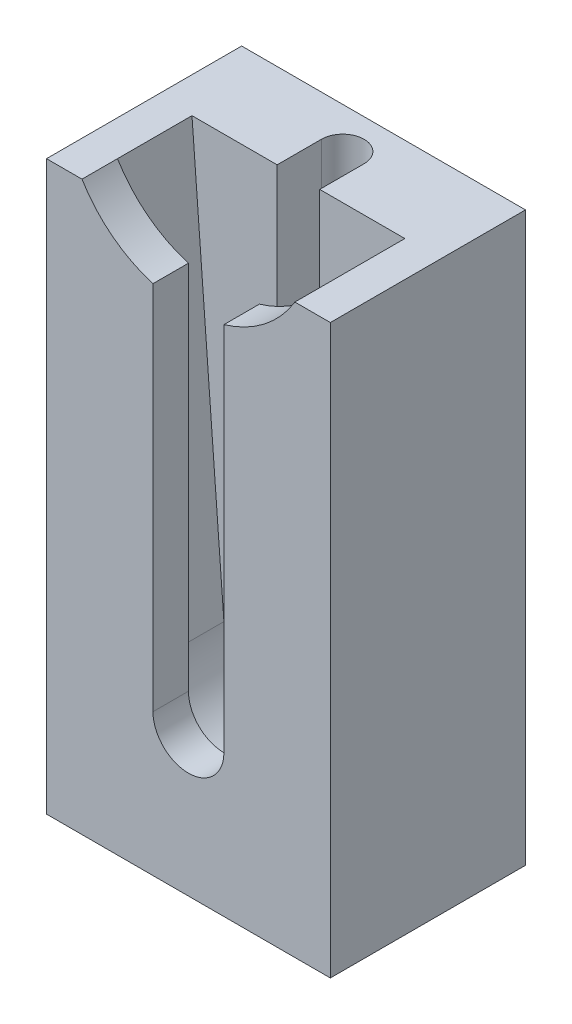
ISO-10303-21;
HEADER;
FILE_DESCRIPTION(('STEP AP214'),'2;1');
FILE_NAME('part.step','',(''),(''),'','','');
FILE_SCHEMA(('AUTOMOTIVE_DESIGN { 1 0 10303 214 1 1 1 1 }'));
ENDSEC;
DATA;
#1=APPLICATION_CONTEXT('core data for automotive mechanical design processes');
#2=APPLICATION_PROTOCOL_DEFINITION('international standard','automotive_design',2000,#1);
#3=PRODUCT_CONTEXT('',#1,'mechanical');
#4=PRODUCT('Part','Part','',(#3));
#5=PRODUCT_RELATED_PRODUCT_CATEGORY('part','',(#4));
#6=PRODUCT_DEFINITION_FORMATION('','',#4);
#7=PRODUCT_DEFINITION_CONTEXT('part definition',#1,'design');
#8=PRODUCT_DEFINITION('design','',#6,#7);
#9=PRODUCT_DEFINITION_SHAPE('','',#8);
#10=(LENGTH_UNIT() NAMED_UNIT(*) SI_UNIT(.MILLI.,.METRE.));
#11=(NAMED_UNIT(*) PLANE_ANGLE_UNIT() SI_UNIT($,.RADIAN.));
#12=(NAMED_UNIT(*) SI_UNIT($,.STERADIAN.) SOLID_ANGLE_UNIT());
#13=UNCERTAINTY_MEASURE_WITH_UNIT(LENGTH_MEASURE(1.E-05),#10,'distance_accuracy_value','');
#14=(GEOMETRIC_REPRESENTATION_CONTEXT(3) GLOBAL_UNCERTAINTY_ASSIGNED_CONTEXT((#13)) GLOBAL_UNIT_ASSIGNED_CONTEXT((#10,
#11,#12)) REPRESENTATION_CONTEXT('',''));
#15=CARTESIAN_POINT('',(0.,0.,0.));
#16=DIRECTION('',(0.,0.,1.));
#17=DIRECTION('',(1.,0.,0.));
#18=AXIS2_PLACEMENT_3D('',#15,#16,#17);
#19=CARTESIAN_POINT('',(0.,16.,4.5));
#20=DIRECTION('',(0.,-1.,0.));
#21=DIRECTION('',(0.,0.,-1.));
#22=AXIS2_PLACEMENT_3D('',#19,#20,#21);
#23=PLANE('',#22);
#24=DIRECTION('',(-1.,0.,0.));
#25=VECTOR('',#24,1.);
#26=CARTESIAN_POINT('',(0.,16.,5.5));
#27=LINE('',#26,#25);
#28=CARTESIAN_POINT('',(1.,16.,5.5));
#29=VERTEX_POINT('',#28);
#30=CARTESIAN_POINT('',(0.,16.,5.5));
#31=VERTEX_POINT('',#30);
#32=EDGE_CURVE('E239',#29,#31,#27,.T.);
#33=ORIENTED_EDGE('',*,*,#32,.F.);
#34=DIRECTION('',(0.,0.,-1.));
#35=VECTOR('',#34,1.);
#36=CARTESIAN_POINT('',(1.,16.,5.5));
#37=LINE('',#36,#35);
#38=CARTESIAN_POINT('',(1.,16.,4.5));
#39=VERTEX_POINT('',#38);
#40=EDGE_CURVE('E161',#29,#39,#37,.T.);
#41=ORIENTED_EDGE('',*,*,#40,.T.);
#42=DIRECTION('',(0.,0.,-1.));
#43=VECTOR('',#42,1.);
#44=CARTESIAN_POINT('',(1.,16.,4.500012));
#45=LINE('',#44,#43);
#46=CARTESIAN_POINT('',(1.,16.,2.4));
#47=VERTEX_POINT('',#46);
#48=EDGE_CURVE('E188',#39,#47,#45,.T.);
#49=ORIENTED_EDGE('',*,*,#48,.T.);
#50=DIRECTION('',(-1.,0.,0.));
#51=VECTOR('',#50,1.);
#52=CARTESIAN_POINT('',(4.,16.,2.4));
#53=LINE('',#52,#51);
#54=CARTESIAN_POINT('',(3.4,16.,2.4));
#55=VERTEX_POINT('',#54);
#56=EDGE_CURVE('E236',#55,#47,#53,.T.);
#57=ORIENTED_EDGE('',*,*,#56,.F.);
#58=DIRECTION('',(0.,0.,-1.));
#59=VECTOR('',#58,1.);
#60=CARTESIAN_POINT('',(3.4,16.,2.4));
#61=LINE('',#60,#59);
#62=CARTESIAN_POINT('',(3.4,16.,1.15));
#63=VERTEX_POINT('',#62);
#64=EDGE_CURVE('E284',#55,#63,#61,.T.);
#65=ORIENTED_EDGE('',*,*,#64,.T.);
#66=CARTESIAN_POINT('',(4.,16.,1.15));
#67=DIRECTION('',(0.,-1.,0.));
#68=DIRECTION('',(0.,0.,-1.));
#69=AXIS2_PLACEMENT_3D('',#66,#67,#68);
#70=CIRCLE('',#69,0.6);
#71=CARTESIAN_POINT('',(4.6,16.,1.15));
#72=VERTEX_POINT('',#71);
#73=EDGE_CURVE('E287',#63,#72,#70,.T.);
#74=ORIENTED_EDGE('',*,*,#73,.T.);
#75=DIRECTION('',(0.,0.,1.));
#76=VECTOR('',#75,1.);
#77=CARTESIAN_POINT('',(4.6,16.,2.4));
#78=LINE('',#77,#76);
#79=CARTESIAN_POINT('',(4.6,16.,2.4));
#80=VERTEX_POINT('',#79);
#81=EDGE_CURVE('E272',#72,#80,#78,.T.);
#82=ORIENTED_EDGE('',*,*,#81,.T.);
#83=CARTESIAN_POINT('',(7.,16.,2.4));
#84=VERTEX_POINT('',#83);
#85=EDGE_CURVE('E187',#84,#80,#53,.T.);
#86=ORIENTED_EDGE('',*,*,#85,.F.);
#87=DIRECTION('',(0.,0.,-1.));
#88=VECTOR('',#87,1.);
#89=CARTESIAN_POINT('',(7.,16.,4.500012));
#90=LINE('',#89,#88);
#91=CARTESIAN_POINT('',(7.,16.,4.5));
#92=VERTEX_POINT('',#91);
#93=EDGE_CURVE('E178',#92,#84,#90,.T.);
#94=ORIENTED_EDGE('',*,*,#93,.F.);
#95=DIRECTION('',(0.,0.,-1.));
#96=VECTOR('',#95,1.);
#97=CARTESIAN_POINT('',(7.,16.,5.5));
#98=LINE('',#97,#96);
#99=CARTESIAN_POINT('',(7.,16.,5.5));
#100=VERTEX_POINT('',#99);
#101=EDGE_CURVE('E153',#92,#100,#98,.F.);
#102=ORIENTED_EDGE('',*,*,#101,.T.);
#103=CARTESIAN_POINT('',(8.,16.,5.5));
#104=VERTEX_POINT('',#103);
#105=EDGE_CURVE('E237',#104,#100,#27,.T.);
#106=ORIENTED_EDGE('',*,*,#105,.F.);
#107=DIRECTION('',(0.,0.,-1.));
#108=VECTOR('',#107,1.);
#109=CARTESIAN_POINT('',(8.,16.,4.5));
#110=LINE('',#109,#108);
#111=CARTESIAN_POINT('',(8.,16.,0.));
#112=VERTEX_POINT('',#111);
#113=EDGE_CURVE('E208',#104,#112,#110,.T.);
#114=ORIENTED_EDGE('',*,*,#113,.T.);
#115=DIRECTION('',(-1.,0.,0.));
#116=VECTOR('',#115,1.);
#117=CARTESIAN_POINT('',(0.,16.,0.));
#118=LINE('',#117,#116);
#119=CARTESIAN_POINT('',(0.,16.,0.));
#120=VERTEX_POINT('',#119);
#121=EDGE_CURVE('E203',#112,#120,#118,.T.);
#122=ORIENTED_EDGE('',*,*,#121,.T.);
#123=DIRECTION('',(0.,0.,-1.));
#124=VECTOR('',#123,1.);
#125=CARTESIAN_POINT('',(0.,16.,4.5));
#126=LINE('',#125,#124);
#127=EDGE_CURVE('E205',#31,#120,#126,.T.);
#128=ORIENTED_EDGE('',*,*,#127,.F.);
#129=EDGE_LOOP('',(#33,#41,#49,#57,#65,#74,#82,#86,#94,#102,#106,#114,#122,#128));
#130=FACE_BOUND('',#129,.T.);
#131=ADVANCED_FACE('F36',(#130),#23,.F.);
#132=CARTESIAN_POINT('',(4.,4.1,2.4));
#133=DIRECTION('',(0.,0.,1.));
#134=DIRECTION('',(1.,0.,0.));
#135=AXIS2_PLACEMENT_3D('',#132,#133,#134);
#136=PLANE('',#135);
#137=CARTESIAN_POINT('',(4.,4.,2.4));
#138=DIRECTION('',(0.,0.,1.));
#139=DIRECTION('',(1.,0.,0.));
#140=AXIS2_PLACEMENT_3D('',#137,#138,#139);
#141=CIRCLE('',#140,0.749999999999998);
#142=CARTESIAN_POINT('',(4.75,4.,2.4));
#143=VERTEX_POINT('',#142);
#144=EDGE_CURVE('E301',#143,#143,#141,.T.);
#145=ORIENTED_EDGE('',*,*,#144,.F.);
#146=EDGE_LOOP('',(#145));
#147=FACE_BOUND('',#146,.T.);
#148=ORIENTED_EDGE('',*,*,#85,.T.);
#149=DIRECTION('',(0.,-1.,0.));
#150=VECTOR('',#149,1.);
#151=CARTESIAN_POINT('',(4.6,39.3937090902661,2.4));
#152=LINE('',#151,#150);
#153=CARTESIAN_POINT('',(4.6,6.,2.4));
#154=VERTEX_POINT('',#153);
#155=EDGE_CURVE('E263',#80,#154,#152,.T.);
#156=ORIENTED_EDGE('',*,*,#155,.T.);
#157=DIRECTION('',(-1.,0.,0.));
#158=VECTOR('',#157,1.);
#159=CARTESIAN_POINT('',(4.,6.,2.4));
#160=LINE('',#159,#158);
#161=CARTESIAN_POINT('',(3.4,6.,2.4));
#162=VERTEX_POINT('',#161);
#163=EDGE_CURVE('E270',#154,#162,#160,.T.);
#164=ORIENTED_EDGE('',*,*,#163,.T.);
#165=DIRECTION('',(0.,-1.,0.));
#166=VECTOR('',#165,1.);
#167=CARTESIAN_POINT('',(3.4,39.3937090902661,2.4));
#168=LINE('',#167,#166);
#169=EDGE_CURVE('E280',#55,#162,#168,.T.);
#170=ORIENTED_EDGE('',*,*,#169,.F.);
#171=ORIENTED_EDGE('',*,*,#56,.T.);
#172=DIRECTION('',(0.0754148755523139,-0.997152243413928,0.));
#173=VECTOR('',#172,1.);
#174=CARTESIAN_POINT('',(1.,16.,2.4));
#175=LINE('',#174,#173);
#176=CARTESIAN_POINT('',(1.9,4.1,2.4));
#177=VERTEX_POINT('',#176);
#178=EDGE_CURVE('E233',#47,#177,#175,.T.);
#179=ORIENTED_EDGE('',*,*,#178,.T.);
#180=CARTESIAN_POINT('',(4.,4.1,2.4));
#181=DIRECTION('',(0.,0.,1.));
#182=DIRECTION('',(1.,0.,0.));
#183=AXIS2_PLACEMENT_3D('',#180,#181,#182);
#184=CIRCLE('',#183,2.1);
#185=CARTESIAN_POINT('',(6.1,4.1,2.4));
#186=VERTEX_POINT('',#185);
#187=EDGE_CURVE('E225',#177,#186,#184,.T.);
#188=ORIENTED_EDGE('',*,*,#187,.T.);
#189=DIRECTION('',(0.0754148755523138,0.997152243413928,0.));
#190=VECTOR('',#189,1.);
#191=CARTESIAN_POINT('',(7.,16.,2.4));
#192=LINE('',#191,#190);
#193=EDGE_CURVE('E229',#186,#84,#192,.T.);
#194=ORIENTED_EDGE('',*,*,#193,.T.);
#195=EDGE_LOOP('',(#148,#156,#164,#170,#171,#179,#188,#194));
#196=FACE_BOUND('',#195,.T.);
#197=ADVANCED_FACE('F314',(#147,#196),#136,.T.);
#198=CARTESIAN_POINT('',(0.,0.,5.5));
#199=DIRECTION('',(0.,0.,-1.));
#200=DIRECTION('',(-1.,0.,0.));
#201=AXIS2_PLACEMENT_3D('',#198,#199,#200);
#202=PLANE('',#201);
#203=ORIENTED_EDGE('',*,*,#105,.T.);
#204=CARTESIAN_POINT('',(4.,17.802775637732,5.5));
#205=DIRECTION('',(0.,0.,-1.));
#206=DIRECTION('',(-1.,0.,0.));
#207=AXIS2_PLACEMENT_3D('',#204,#205,#206);
#208=CIRCLE('',#207,3.5);
#209=CARTESIAN_POINT('',(5.,14.4486736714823,5.5));
#210=VERTEX_POINT('',#209);
#211=EDGE_CURVE('E156',#100,#210,#208,.T.);
#212=ORIENTED_EDGE('',*,*,#211,.T.);
#213=DIRECTION('',(0.,-1.,0.));
#214=VECTOR('',#213,1.);
#215=CARTESIAN_POINT('',(5.,4.,5.5));
#216=LINE('',#215,#214);
#217=CARTESIAN_POINT('',(5.,4.,5.5));
#218=VERTEX_POINT('',#217);
#219=EDGE_CURVE('E261',#210,#218,#216,.T.);
#220=ORIENTED_EDGE('',*,*,#219,.T.);
#221=CARTESIAN_POINT('',(4.,4.,5.5));
#222=DIRECTION('',(0.,0.,-1.));
#223=DIRECTION('',(-1.,0.,0.));
#224=AXIS2_PLACEMENT_3D('',#221,#222,#223);
#225=CIRCLE('',#224,1.);
#226=CARTESIAN_POINT('',(3.,4.,5.5));
#227=VERTEX_POINT('',#226);
#228=EDGE_CURVE('E259',#218,#227,#225,.T.);
#229=ORIENTED_EDGE('',*,*,#228,.T.);
#230=DIRECTION('',(0.,1.,0.));
#231=VECTOR('',#230,1.);
#232=CARTESIAN_POINT('',(3.,16.,5.5));
#233=LINE('',#232,#231);
#234=CARTESIAN_POINT('',(3.,14.4486736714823,5.5));
#235=VERTEX_POINT('',#234);
#236=EDGE_CURVE('E255',#227,#235,#233,.T.);
#237=ORIENTED_EDGE('',*,*,#236,.T.);
#238=EDGE_CURVE('E59',#235,#29,#208,.T.);
#239=ORIENTED_EDGE('',*,*,#238,.T.);
#240=ORIENTED_EDGE('',*,*,#32,.T.);
#241=DIRECTION('',(0.,-1.,0.));
#242=VECTOR('',#241,1.);
#243=CARTESIAN_POINT('',(0.,0.,5.5));
#244=LINE('',#243,#242);
#245=CARTESIAN_POINT('',(0.,0.,5.5));
#246=VERTEX_POINT('',#245);
#247=EDGE_CURVE('E246',#31,#246,#244,.T.);
#248=ORIENTED_EDGE('',*,*,#247,.T.);
#249=DIRECTION('',(1.,0.,0.));
#250=VECTOR('',#249,1.);
#251=CARTESIAN_POINT('',(8.,0.,5.5));
#252=LINE('',#251,#250);
#253=CARTESIAN_POINT('',(8.,0.,5.5));
#254=VERTEX_POINT('',#253);
#255=EDGE_CURVE('E243',#246,#254,#252,.T.);
#256=ORIENTED_EDGE('',*,*,#255,.T.);
#257=DIRECTION('',(0.,1.,0.));
#258=VECTOR('',#257,1.);
#259=CARTESIAN_POINT('',(8.,16.,5.5));
#260=LINE('',#259,#258);
#261=EDGE_CURVE('E240',#254,#104,#260,.T.);
#262=ORIENTED_EDGE('',*,*,#261,.T.);
#263=EDGE_LOOP('',(#203,#212,#220,#229,#237,#239,#240,#248,#256,#262));
#264=FACE_BOUND('',#263,.T.);
#265=ADVANCED_FACE('F346',(#264),#202,.F.);
#266=CARTESIAN_POINT('',(0.,0.,4.5));
#267=DIRECTION('',(1.,0.,0.));
#268=DIRECTION('',(0.,0.,-1.));
#269=AXIS2_PLACEMENT_3D('',#266,#267,#268);
#270=PLANE('',#269);
#271=DIRECTION('',(0.,-1.,0.));
#272=VECTOR('',#271,1.);
#273=CARTESIAN_POINT('',(0.,0.,0.));
#274=LINE('',#273,#272);
#275=CARTESIAN_POINT('',(0.,0.,0.));
#276=VERTEX_POINT('',#275);
#277=EDGE_CURVE('E191',#120,#276,#274,.T.);
#278=ORIENTED_EDGE('',*,*,#277,.T.);
#279=DIRECTION('',(0.,0.,-1.));
#280=VECTOR('',#279,1.);
#281=CARTESIAN_POINT('',(0.,0.,4.5));
#282=LINE('',#281,#280);
#283=EDGE_CURVE('E214',#246,#276,#282,.T.);
#284=ORIENTED_EDGE('',*,*,#283,.F.);
#285=ORIENTED_EDGE('',*,*,#247,.F.);
#286=ORIENTED_EDGE('',*,*,#127,.T.);
#287=EDGE_LOOP('',(#278,#284,#285,#286));
#288=FACE_BOUND('',#287,.T.);
#289=ADVANCED_FACE('F38',(#288),#270,.F.);
#290=CARTESIAN_POINT('',(0.,0.,4.5));
#291=DIRECTION('',(0.,1.,0.));
#292=DIRECTION('',(0.,0.,1.));
#293=AXIS2_PLACEMENT_3D('',#290,#291,#292);
#294=PLANE('',#293);
#295=DIRECTION('',(1.,0.,0.));
#296=VECTOR('',#295,1.);
#297=CARTESIAN_POINT('',(0.,0.,0.));
#298=LINE('',#297,#296);
#299=CARTESIAN_POINT('',(8.,0.,0.));
#300=VERTEX_POINT('',#299);
#301=EDGE_CURVE('E199',#276,#300,#298,.T.);
#302=ORIENTED_EDGE('',*,*,#301,.T.);
#303=DIRECTION('',(0.,0.,-1.));
#304=VECTOR('',#303,1.);
#305=CARTESIAN_POINT('',(8.,0.,4.5));
#306=LINE('',#305,#304);
#307=EDGE_CURVE('E211',#254,#300,#306,.T.);
#308=ORIENTED_EDGE('',*,*,#307,.F.);
#309=ORIENTED_EDGE('',*,*,#255,.F.);
#310=ORIENTED_EDGE('',*,*,#283,.T.);
#311=EDGE_LOOP('',(#302,#308,#309,#310));
#312=FACE_BOUND('',#311,.T.);
#313=ADVANCED_FACE('F355',(#312),#294,.F.);
#314=CARTESIAN_POINT('',(8.,0.,4.5));
#315=DIRECTION('',(-1.,0.,0.));
#316=DIRECTION('',(0.,0.,1.));
#317=AXIS2_PLACEMENT_3D('',#314,#315,#316);
#318=PLANE('',#317);
#319=DIRECTION('',(0.,1.,0.));
#320=VECTOR('',#319,1.);
#321=CARTESIAN_POINT('',(8.,0.,0.));
#322=LINE('',#321,#320);
#323=EDGE_CURVE('E201',#300,#112,#322,.T.);
#324=ORIENTED_EDGE('',*,*,#323,.T.);
#325=ORIENTED_EDGE('',*,*,#113,.F.);
#326=ORIENTED_EDGE('',*,*,#261,.F.);
#327=ORIENTED_EDGE('',*,*,#307,.T.);
#328=EDGE_LOOP('',(#324,#325,#326,#327));
#329=FACE_BOUND('',#328,.T.);
#330=ADVANCED_FACE('F353',(#329),#318,.F.);
#331=CARTESIAN_POINT('',(0.,0.,0.));
#332=DIRECTION('',(0.,0.,-1.));
#333=DIRECTION('',(-1.,0.,0.));
#334=AXIS2_PLACEMENT_3D('',#331,#332,#333);
#335=PLANE('',#334);
#336=CARTESIAN_POINT('',(4.,4.,0.));
#337=DIRECTION('',(0.,0.,-1.));
#338=DIRECTION('',(-1.,0.,0.));
#339=AXIS2_PLACEMENT_3D('',#336,#337,#338);
#340=CIRCLE('',#339,0.749999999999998);
#341=CARTESIAN_POINT('',(3.25,4.,0.));
#342=VERTEX_POINT('',#341);
#343=EDGE_CURVE('E40',#342,#342,#340,.T.);
#344=ORIENTED_EDGE('',*,*,#343,.F.);
#345=EDGE_LOOP('',(#344));
#346=FACE_BOUND('',#345,.T.);
#347=ORIENTED_EDGE('',*,*,#277,.F.);
#348=ORIENTED_EDGE('',*,*,#121,.F.);
#349=ORIENTED_EDGE('',*,*,#323,.F.);
#350=ORIENTED_EDGE('',*,*,#301,.F.);
#351=EDGE_LOOP('',(#347,#348,#349,#350));
#352=FACE_BOUND('',#351,.T.);
#353=ADVANCED_FACE('F351',(#346,#352),#335,.T.);
#354=CARTESIAN_POINT('',(1.,16.,4.500012));
#355=DIRECTION('',(0.997152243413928,0.0754148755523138,0.));
#356=DIRECTION('',(-0.0754148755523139,0.997152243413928,0.));
#357=AXIS2_PLACEMENT_3D('',#354,#355,#356);
#358=PLANE('',#357);
#359=DIRECTION('',(0.0754148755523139,-0.997152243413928,0.));
#360=VECTOR('',#359,1.);
#361=CARTESIAN_POINT('',(2.19751439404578,0.166198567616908,4.5));
#362=LINE('',#361,#360);
#363=CARTESIAN_POINT('',(1.9,4.1,4.5));
#364=VERTEX_POINT('',#363);
#365=EDGE_CURVE('E45',#39,#364,#362,.T.);
#366=ORIENTED_EDGE('',*,*,#365,.T.);
#367=DIRECTION('',(0.,0.,1.));
#368=VECTOR('',#367,1.);
#369=CARTESIAN_POINT('',(1.9,4.1,2.4));
#370=LINE('',#369,#368);
#371=EDGE_CURVE('E193',#177,#364,#370,.T.);
#372=ORIENTED_EDGE('',*,*,#371,.F.);
#373=ORIENTED_EDGE('',*,*,#178,.F.);
#374=ORIENTED_EDGE('',*,*,#48,.F.);
#375=EDGE_LOOP('',(#366,#372,#373,#374));
#376=FACE_BOUND('',#375,.T.);
#377=ADVANCED_FACE('F312',(#376),#358,.T.);
#378=CARTESIAN_POINT('',(7.,16.,4.500012));
#379=DIRECTION('',(-0.997152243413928,0.0754148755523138,0.));
#380=DIRECTION('',(-0.0754148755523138,-0.997152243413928,0.));
#381=AXIS2_PLACEMENT_3D('',#378,#379,#380);
#382=PLANE('',#381);
#383=DIRECTION('',(0.0754148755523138,0.997152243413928,0.));
#384=VECTOR('',#383,1.);
#385=CARTESIAN_POINT('',(5.75698637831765,-0.435402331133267,4.5));
#386=LINE('',#385,#384);
#387=CARTESIAN_POINT('',(6.1,4.1,4.5));
#388=VERTEX_POINT('',#387);
#389=EDGE_CURVE('E170',#388,#92,#386,.T.);
#390=ORIENTED_EDGE('',*,*,#389,.T.);
#391=ORIENTED_EDGE('',*,*,#93,.T.);
#392=ORIENTED_EDGE('',*,*,#193,.F.);
#393=DIRECTION('',(0.,0.,1.));
#394=VECTOR('',#393,1.);
#395=CARTESIAN_POINT('',(6.1,4.1,2.4));
#396=LINE('',#395,#394);
#397=EDGE_CURVE('E180',#186,#388,#396,.T.);
#398=ORIENTED_EDGE('',*,*,#397,.T.);
#399=EDGE_LOOP('',(#390,#391,#392,#398));
#400=FACE_BOUND('',#399,.T.);
#401=ADVANCED_FACE('F176',(#400),#382,.T.);
#402=CARTESIAN_POINT('',(4.,4.1,2.4));
#403=DIRECTION('',(0.,0.,1.));
#404=DIRECTION('',(1.,0.,0.));
#405=AXIS2_PLACEMENT_3D('',#402,#403,#404);
#406=CYLINDRICAL_SURFACE('',#405,2.1);
#407=ORIENTED_EDGE('',*,*,#397,.F.);
#408=ORIENTED_EDGE('',*,*,#187,.F.);
#409=ORIENTED_EDGE('',*,*,#371,.T.);
#410=CARTESIAN_POINT('',(4.,4.1,4.5));
#411=DIRECTION('',(0.,0.,1.));
#412=DIRECTION('',(1.,0.,0.));
#413=AXIS2_PLACEMENT_3D('',#410,#411,#412);
#414=CIRCLE('',#413,2.1);
#415=EDGE_CURVE('E182',#388,#364,#414,.F.);
#416=ORIENTED_EDGE('',*,*,#415,.F.);
#417=EDGE_LOOP('',(#407,#408,#409,#416));
#418=FACE_BOUND('',#417,.T.);
#419=ADVANCED_FACE('F222',(#418),#406,.F.);
#420=CARTESIAN_POINT('',(0.,0.,4.5));
#421=DIRECTION('',(0.,0.,-1.));
#422=DIRECTION('',(-1.,0.,0.));
#423=AXIS2_PLACEMENT_3D('',#420,#421,#422);
#424=PLANE('',#423);
#425=CARTESIAN_POINT('',(4.,17.802775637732,4.5));
#426=DIRECTION('',(0.,0.,-1.));
#427=DIRECTION('',(-1.,0.,0.));
#428=AXIS2_PLACEMENT_3D('',#425,#426,#427);
#429=CIRCLE('',#428,3.5);
#430=CARTESIAN_POINT('',(5.,14.4486736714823,4.5));
#431=VERTEX_POINT('',#430);
#432=EDGE_CURVE('E52',#92,#431,#429,.T.);
#433=ORIENTED_EDGE('',*,*,#432,.F.);
#434=ORIENTED_EDGE('',*,*,#389,.F.);
#435=ORIENTED_EDGE('',*,*,#415,.T.);
#436=ORIENTED_EDGE('',*,*,#365,.F.);
#437=CARTESIAN_POINT('',(3.,14.4486736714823,4.5));
#438=VERTEX_POINT('',#437);
#439=EDGE_CURVE('E173',#438,#39,#429,.T.);
#440=ORIENTED_EDGE('',*,*,#439,.F.);
#441=DIRECTION('',(0.,1.,0.));
#442=VECTOR('',#441,1.);
#443=CARTESIAN_POINT('',(3.,16.,4.5));
#444=LINE('',#443,#442);
#445=CARTESIAN_POINT('',(3.,4.,4.5));
#446=VERTEX_POINT('',#445);
#447=EDGE_CURVE('E258',#446,#438,#444,.T.);
#448=ORIENTED_EDGE('',*,*,#447,.F.);
#449=CARTESIAN_POINT('',(4.,4.,4.5));
#450=DIRECTION('',(0.,0.,-1.));
#451=DIRECTION('',(-1.,0.,0.));
#452=AXIS2_PLACEMENT_3D('',#449,#450,#451);
#453=CIRCLE('',#452,1.);
#454=CARTESIAN_POINT('',(5.,4.,4.5));
#455=VERTEX_POINT('',#454);
#456=EDGE_CURVE('E264',#455,#446,#453,.T.);
#457=ORIENTED_EDGE('',*,*,#456,.F.);
#458=DIRECTION('',(0.,-1.,0.));
#459=VECTOR('',#458,1.);
#460=CARTESIAN_POINT('',(5.,4.,4.5));
#461=LINE('',#460,#459);
#462=EDGE_CURVE('E172',#431,#455,#461,.T.);
#463=ORIENTED_EDGE('',*,*,#462,.F.);
#464=EDGE_LOOP('',(#433,#434,#435,#436,#440,#448,#457,#463));
#465=FACE_BOUND('',#464,.T.);
#466=ADVANCED_FACE('F168',(#465),#424,.T.);
#467=CARTESIAN_POINT('',(5.,4.,28.8937090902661));
#468=DIRECTION('',(-1.,0.,0.));
#469=DIRECTION('',(0.,-1.,0.));
#470=AXIS2_PLACEMENT_3D('',#467,#468,#469);
#471=PLANE('',#470);
#472=DIRECTION('',(0.,0.,-1.));
#473=VECTOR('',#472,1.);
#474=CARTESIAN_POINT('',(5.,14.4486736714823,5.5));
#475=LINE('',#474,#473);
#476=EDGE_CURVE('E162',#431,#210,#475,.F.);
#477=ORIENTED_EDGE('',*,*,#476,.F.);
#478=ORIENTED_EDGE('',*,*,#462,.T.);
#479=DIRECTION('',(0.,0.,-1.));
#480=VECTOR('',#479,1.);
#481=CARTESIAN_POINT('',(5.,4.,28.8937090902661));
#482=LINE('',#481,#480);
#483=EDGE_CURVE('E249',#218,#455,#482,.T.);
#484=ORIENTED_EDGE('',*,*,#483,.F.);
#485=ORIENTED_EDGE('',*,*,#219,.F.);
#486=EDGE_LOOP('',(#477,#478,#484,#485));
#487=FACE_BOUND('',#486,.T.);
#488=ADVANCED_FACE('F381',(#487),#471,.T.);
#489=CARTESIAN_POINT('',(4.,4.,28.8937090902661));
#490=DIRECTION('',(0.,0.,-1.));
#491=DIRECTION('',(-1.,0.,0.));
#492=AXIS2_PLACEMENT_3D('',#489,#490,#491);
#493=CYLINDRICAL_SURFACE('',#492,1.);
#494=ORIENTED_EDGE('',*,*,#228,.F.);
#495=ORIENTED_EDGE('',*,*,#483,.T.);
#496=ORIENTED_EDGE('',*,*,#456,.T.);
#497=DIRECTION('',(0.,0.,-1.));
#498=VECTOR('',#497,1.);
#499=CARTESIAN_POINT('',(3.,4.,28.8937090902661));
#500=LINE('',#499,#498);
#501=EDGE_CURVE('E252',#227,#446,#500,.T.);
#502=ORIENTED_EDGE('',*,*,#501,.F.);
#503=EDGE_LOOP('',(#494,#495,#496,#502));
#504=FACE_BOUND('',#503,.T.);
#505=ADVANCED_FACE('F377',(#504),#493,.F.);
#506=CARTESIAN_POINT('',(3.,16.,28.8937090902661));
#507=DIRECTION('',(1.,0.,0.));
#508=DIRECTION('',(0.,1.,0.));
#509=AXIS2_PLACEMENT_3D('',#506,#507,#508);
#510=PLANE('',#509);
#511=DIRECTION('',(0.,0.,-1.));
#512=VECTOR('',#511,1.);
#513=CARTESIAN_POINT('',(3.,14.4486736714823,5.5));
#514=LINE('',#513,#512);
#515=EDGE_CURVE('E11',#235,#438,#514,.T.);
#516=ORIENTED_EDGE('',*,*,#515,.F.);
#517=ORIENTED_EDGE('',*,*,#236,.F.);
#518=ORIENTED_EDGE('',*,*,#501,.T.);
#519=ORIENTED_EDGE('',*,*,#447,.T.);
#520=EDGE_LOOP('',(#516,#517,#518,#519));
#521=FACE_BOUND('',#520,.T.);
#522=ADVANCED_FACE('F375',(#521),#510,.T.);
#523=CARTESIAN_POINT('',(4.6,39.3937090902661,2.4));
#524=DIRECTION('',(-1.,0.,0.));
#525=DIRECTION('',(0.,0.,1.));
#526=AXIS2_PLACEMENT_3D('',#523,#524,#525);
#527=PLANE('',#526);
#528=ORIENTED_EDGE('',*,*,#81,.F.);
#529=DIRECTION('',(0.,-1.,0.));
#530=VECTOR('',#529,1.);
#531=CARTESIAN_POINT('',(4.6,39.3937090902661,1.15));
#532=LINE('',#531,#530);
#533=CARTESIAN_POINT('',(4.6,6.,1.15));
#534=VERTEX_POINT('',#533);
#535=EDGE_CURVE('E274',#72,#534,#532,.T.);
#536=ORIENTED_EDGE('',*,*,#535,.T.);
#537=DIRECTION('',(0.,0.,1.));
#538=VECTOR('',#537,1.);
#539=CARTESIAN_POINT('',(4.6,6.,2.4));
#540=LINE('',#539,#538);
#541=EDGE_CURVE('E283',#534,#154,#540,.T.);
#542=ORIENTED_EDGE('',*,*,#541,.T.);
#543=ORIENTED_EDGE('',*,*,#155,.F.);
#544=EDGE_LOOP('',(#528,#536,#542,#543));
#545=FACE_BOUND('',#544,.T.);
#546=ADVANCED_FACE('F327',(#545),#527,.T.);
#547=CARTESIAN_POINT('',(4.,39.3937090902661,1.15));
#548=DIRECTION('',(0.,-1.,0.));
#549=DIRECTION('',(0.,0.,-1.));
#550=AXIS2_PLACEMENT_3D('',#547,#548,#549);
#551=CYLINDRICAL_SURFACE('',#550,0.6);
#552=ORIENTED_EDGE('',*,*,#73,.F.);
#553=DIRECTION('',(0.,-1.,0.));
#554=VECTOR('',#553,1.);
#555=CARTESIAN_POINT('',(3.4,39.3937090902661,1.15));
#556=LINE('',#555,#554);
#557=CARTESIAN_POINT('',(3.4,6.,1.15));
#558=VERTEX_POINT('',#557);
#559=EDGE_CURVE('E277',#63,#558,#556,.T.);
#560=ORIENTED_EDGE('',*,*,#559,.T.);
#561=CARTESIAN_POINT('',(4.,6.,1.15));
#562=DIRECTION('',(0.,-1.,0.));
#563=DIRECTION('',(0.,0.,-1.));
#564=AXIS2_PLACEMENT_3D('',#561,#562,#563);
#565=CIRCLE('',#564,0.6);
#566=EDGE_CURVE('E290',#558,#534,#565,.T.);
#567=ORIENTED_EDGE('',*,*,#566,.T.);
#568=ORIENTED_EDGE('',*,*,#535,.F.);
#569=EDGE_LOOP('',(#552,#560,#567,#568));
#570=FACE_BOUND('',#569,.T.);
#571=ADVANCED_FACE('F322',(#570),#551,.F.);
#572=CARTESIAN_POINT('',(3.4,39.3937090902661,2.4));
#573=DIRECTION('',(1.,0.,0.));
#574=DIRECTION('',(0.,0.,-1.));
#575=AXIS2_PLACEMENT_3D('',#572,#573,#574);
#576=PLANE('',#575);
#577=ORIENTED_EDGE('',*,*,#64,.F.);
#578=ORIENTED_EDGE('',*,*,#169,.T.);
#579=DIRECTION('',(0.,0.,-1.));
#580=VECTOR('',#579,1.);
#581=CARTESIAN_POINT('',(3.4,6.,2.4));
#582=LINE('',#581,#580);
#583=EDGE_CURVE('E286',#162,#558,#582,.T.);
#584=ORIENTED_EDGE('',*,*,#583,.T.);
#585=ORIENTED_EDGE('',*,*,#559,.F.);
#586=EDGE_LOOP('',(#577,#578,#584,#585));
#587=FACE_BOUND('',#586,.T.);
#588=ADVANCED_FACE('F319',(#587),#576,.T.);
#589=CARTESIAN_POINT('',(0.,6.,4.5));
#590=DIRECTION('',(0.,-1.,0.));
#591=DIRECTION('',(0.,0.,-1.));
#592=AXIS2_PLACEMENT_3D('',#589,#590,#591);
#593=PLANE('',#592);
#594=ORIENTED_EDGE('',*,*,#566,.F.);
#595=ORIENTED_EDGE('',*,*,#583,.F.);
#596=ORIENTED_EDGE('',*,*,#163,.F.);
#597=ORIENTED_EDGE('',*,*,#541,.F.);
#598=EDGE_LOOP('',(#594,#595,#596,#597));
#599=FACE_BOUND('',#598,.T.);
#600=ADVANCED_FACE('F330',(#599),#593,.F.);
#601=CARTESIAN_POINT('',(4.,17.802775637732,5.5));
#602=DIRECTION('',(0.,0.,-1.));
#603=DIRECTION('',(-1.,0.,0.));
#604=AXIS2_PLACEMENT_3D('',#601,#602,#603);
#605=CYLINDRICAL_SURFACE('',#604,3.5);
#606=ORIENTED_EDGE('',*,*,#238,.F.);
#607=ORIENTED_EDGE('',*,*,#515,.T.);
#608=ORIENTED_EDGE('',*,*,#439,.T.);
#609=ORIENTED_EDGE('',*,*,#40,.F.);
#610=EDGE_LOOP('',(#606,#607,#608,#609));
#611=FACE_BOUND('',#610,.T.);
#612=ADVANCED_FACE('F308',(#611),#605,.F.);
#613=ORIENTED_EDGE('',*,*,#432,.T.);
#614=ORIENTED_EDGE('',*,*,#476,.T.);
#615=ORIENTED_EDGE('',*,*,#211,.F.);
#616=ORIENTED_EDGE('',*,*,#101,.F.);
#617=EDGE_LOOP('',(#613,#614,#615,#616));
#618=FACE_BOUND('',#617,.T.);
#619=ADVANCED_FACE('F154',(#618),#605,.F.);
#620=CARTESIAN_POINT('',(4.,4.,-0.100000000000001));
#621=DIRECTION('',(0.,0.,1.));
#622=DIRECTION('',(1.,0.,0.));
#623=AXIS2_PLACEMENT_3D('',#620,#621,#622);
#624=CYLINDRICAL_SURFACE('',#623,0.749999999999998);
#625=ORIENTED_EDGE('',*,*,#343,.T.);
#626=EDGE_LOOP('',(#625));
#627=FACE_BOUND('',#626,.T.);
#628=ORIENTED_EDGE('',*,*,#144,.T.);
#629=EDGE_LOOP('',(#628));
#630=FACE_BOUND('',#629,.T.);
#631=ADVANCED_FACE('F504',(#627,#630),#624,.F.);
#632=CLOSED_SHELL('',(#131,#197,#265,#289,#313,#330,#353,#377,#401,#419,#466,#488,#505,#522,
#546,#571,#588,#600,#612,#619,#631));
#633=MANIFOLD_SOLID_BREP('B2',#632);
#634=ADVANCED_BREP_SHAPE_REPRESENTATION('',(#18,#633),#14);
#635=SHAPE_DEFINITION_REPRESENTATION(#9,#634);
ENDSEC;
END-ISO-10303-21;
